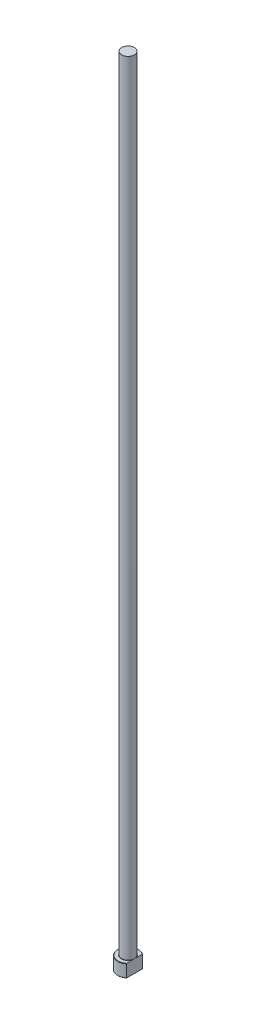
from build123d import *
from build123d.topology import SkipClean

# Parameters (mm, degrees)
CHAMFER1_SIZE    = 0.2
FILLET1_R        = 0.2
KEYED_HEAD_DEPTH = 501.084492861


with BuildPart() as part:
    # Sketch1 → Revolve1 (revolve)
    with BuildSketch(Plane.XY, mode=Mode.PRIVATE) as revolve1_sk:
        Polygon((0, 0), (-6.5, 0), (-6.5, 8), (-4, 8), (-4, 500), (0, 500), align=None)
    revolve(revolve1_sk.sketch.rotate(Axis((0, 259.958771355, 0), (0, -1, 0)), 270), axis=Axis((0, 259.958771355, 0), (0, -1, 0)))

    # Chamfer1
    chamfer1_edges = [part.edges().sort_by_distance(p)[0] for p in [
        (0, 8, -6.5),
        (0, 0, -6.5),
    ]]
    chamfer(chamfer1_edges, length=CHAMFER1_SIZE)

    # Fillet1
    fillet1_edges = [part.edges().sort_by_distance(p)[0] for p in [
        (0, 8, -4),
    ]]
    fillet(fillet1_edges, radius=FILLET1_R)

    # Sketch2 → KEYED HEAD (cut, through all)
    with SkipClean():  # the faces are left unmerged after this step: merging them gives an invalid solid
        with BuildSketch(Plane(origin=(0, 0, 0), x_dir=(1, 0, 0), z_dir=(0, 1, 0))):
            with BuildLine():
                Line((4, -5.123475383), (4, 5.123475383))
                ThreePointArc((4, 5.123475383), (6.5, 0), (4, -5.123475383))
            make_face()
        extrude(amount=KEYED_HEAD_DEPTH, mode=Mode.SUBTRACT)


solid = part.part
